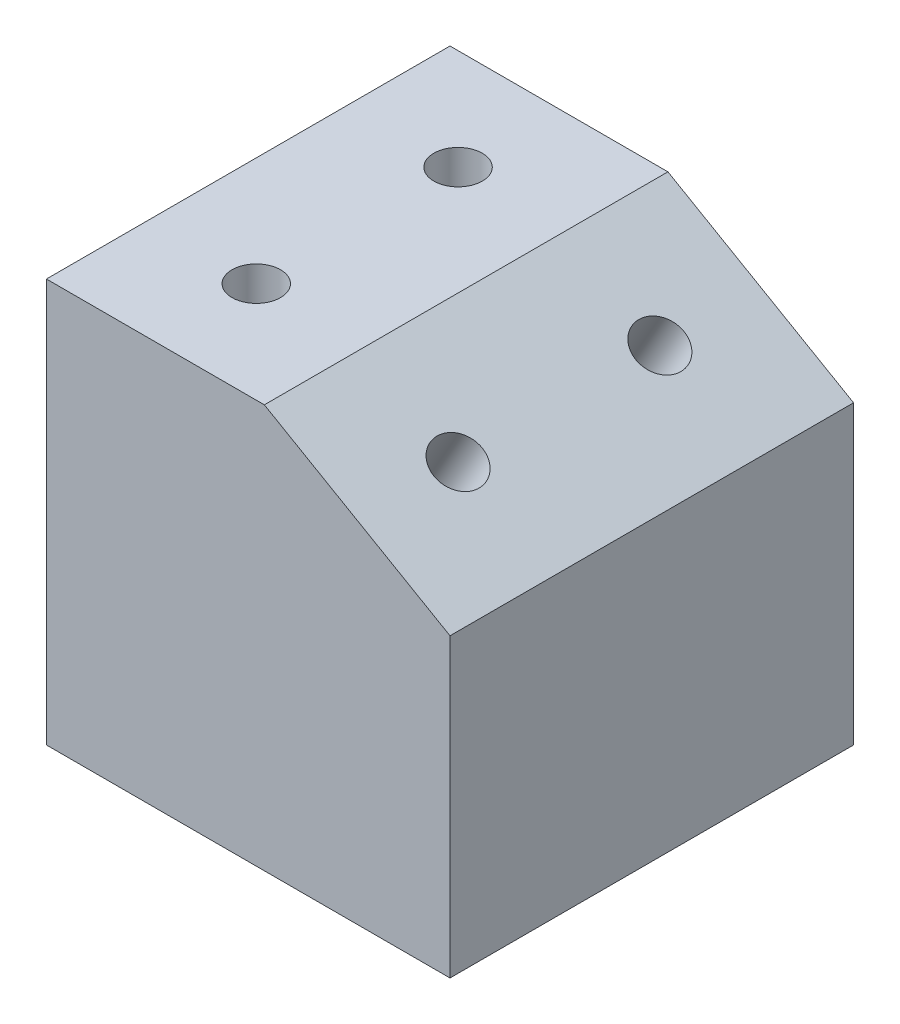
ISO-10303-21;
HEADER;
FILE_DESCRIPTION(('STEP AP214'),'2;1');
FILE_NAME('part.step','',(''),(''),'','','');
FILE_SCHEMA(('AUTOMOTIVE_DESIGN { 1 0 10303 214 1 1 1 1 }'));
ENDSEC;
DATA;
#1=APPLICATION_CONTEXT('core data for automotive mechanical design processes');
#2=APPLICATION_PROTOCOL_DEFINITION('international standard','automotive_design',2000,#1);
#3=PRODUCT_CONTEXT('',#1,'mechanical');
#4=PRODUCT('Part','Part','',(#3));
#5=PRODUCT_RELATED_PRODUCT_CATEGORY('part','',(#4));
#6=PRODUCT_DEFINITION_FORMATION('','',#4);
#7=PRODUCT_DEFINITION_CONTEXT('part definition',#1,'design');
#8=PRODUCT_DEFINITION('design','',#6,#7);
#9=PRODUCT_DEFINITION_SHAPE('','',#8);
#10=(LENGTH_UNIT() NAMED_UNIT(*) SI_UNIT(.MILLI.,.METRE.));
#11=(NAMED_UNIT(*) PLANE_ANGLE_UNIT() SI_UNIT($,.RADIAN.));
#12=(NAMED_UNIT(*) SI_UNIT($,.STERADIAN.) SOLID_ANGLE_UNIT());
#13=UNCERTAINTY_MEASURE_WITH_UNIT(LENGTH_MEASURE(1.E-05),#10,'distance_accuracy_value','');
#14=(GEOMETRIC_REPRESENTATION_CONTEXT(3) GLOBAL_UNCERTAINTY_ASSIGNED_CONTEXT((#13)) GLOBAL_UNIT_ASSIGNED_CONTEXT((#10,
#11,#12)) REPRESENTATION_CONTEXT('',''));
#15=CARTESIAN_POINT('',(0.,0.,0.));
#16=DIRECTION('',(0.,0.,1.));
#17=DIRECTION('',(1.,0.,0.));
#18=AXIS2_PLACEMENT_3D('',#15,#16,#17);
#19=CARTESIAN_POINT('',(-25.,-25.,50.));
#20=DIRECTION('',(1.,0.,0.));
#21=DIRECTION('',(0.,0.,-1.));
#22=AXIS2_PLACEMENT_3D('',#19,#20,#21);
#23=PLANE('',#22);
#24=CARTESIAN_POINT('',(-25.,5.,5.00000000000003));
#25=DIRECTION('',(-1.,0.,0.));
#26=DIRECTION('',(0.,0.,1.));
#27=AXIS2_PLACEMENT_3D('',#24,#25,#26);
#28=CIRCLE('',#27,3.4);
#29=CARTESIAN_POINT('',(-25.,5.,8.40000000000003));
#30=VERTEX_POINT('',#29);
#31=EDGE_CURVE('E279',#30,#30,#28,.T.);
#32=ORIENTED_EDGE('',*,*,#31,.F.);
#33=EDGE_LOOP('',(#32));
#34=FACE_BOUND('',#33,.T.);
#35=CARTESIAN_POINT('',(-25.,5.,45.));
#36=DIRECTION('',(-1.,0.,0.));
#37=DIRECTION('',(0.,0.,1.));
#38=AXIS2_PLACEMENT_3D('',#35,#36,#37);
#39=CIRCLE('',#38,3.4);
#40=CARTESIAN_POINT('',(-25.,5.,48.4));
#41=VERTEX_POINT('',#40);
#42=EDGE_CURVE('E278',#41,#41,#39,.T.);
#43=ORIENTED_EDGE('',*,*,#42,.F.);
#44=EDGE_LOOP('',(#43));
#45=FACE_BOUND('',#44,.T.);
#46=CARTESIAN_POINT('',(-25.,-15.,5.00000000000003));
#47=DIRECTION('',(-1.,0.,0.));
#48=DIRECTION('',(0.,0.,1.));
#49=AXIS2_PLACEMENT_3D('',#46,#47,#48);
#50=CIRCLE('',#49,3.4);
#51=CARTESIAN_POINT('',(-25.,-15.,8.40000000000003));
#52=VERTEX_POINT('',#51);
#53=EDGE_CURVE('E250',#52,#52,#50,.T.);
#54=ORIENTED_EDGE('',*,*,#53,.F.);
#55=EDGE_LOOP('',(#54));
#56=FACE_BOUND('',#55,.T.);
#57=CARTESIAN_POINT('',(-25.,-15.,45.));
#58=DIRECTION('',(-1.,0.,0.));
#59=DIRECTION('',(0.,0.,1.));
#60=AXIS2_PLACEMENT_3D('',#57,#58,#59);
#61=CIRCLE('',#60,3.4);
#62=CARTESIAN_POINT('',(-25.,-15.,48.4));
#63=VERTEX_POINT('',#62);
#64=EDGE_CURVE('E249',#63,#63,#61,.T.);
#65=ORIENTED_EDGE('',*,*,#64,.F.);
#66=EDGE_LOOP('',(#65));
#67=FACE_BOUND('',#66,.T.);
#68=CARTESIAN_POINT('',(-25.,-5.,37.5));
#69=DIRECTION('',(-1.,0.,0.));
#70=DIRECTION('',(0.,0.,1.));
#71=AXIS2_PLACEMENT_3D('',#68,#69,#70);
#72=CIRCLE('',#71,5.99999999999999);
#73=CARTESIAN_POINT('',(-25.,-5.,43.5));
#74=VERTEX_POINT('',#73);
#75=EDGE_CURVE('E328',#74,#74,#72,.T.);
#76=ORIENTED_EDGE('',*,*,#75,.F.);
#77=EDGE_LOOP('',(#76));
#78=FACE_BOUND('',#77,.T.);
#79=CARTESIAN_POINT('',(-25.,-5.,12.5));
#80=DIRECTION('',(-1.,0.,0.));
#81=DIRECTION('',(0.,0.,1.));
#82=AXIS2_PLACEMENT_3D('',#79,#80,#81);
#83=CIRCLE('',#82,5.99999999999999);
#84=CARTESIAN_POINT('',(-25.,-5.,18.5));
#85=VERTEX_POINT('',#84);
#86=EDGE_CURVE('E408',#85,#85,#83,.T.);
#87=ORIENTED_EDGE('',*,*,#86,.F.);
#88=EDGE_LOOP('',(#87));
#89=FACE_BOUND('',#88,.T.);
#90=DIRECTION('',(0.,-1.,0.));
#91=VECTOR('',#90,1.);
#92=CARTESIAN_POINT('',(-25.,-25.,0.));
#93=LINE('',#92,#91);
#94=CARTESIAN_POINT('',(-25.,25.,0.));
#95=VERTEX_POINT('',#94);
#96=CARTESIAN_POINT('',(-25.,-25.,0.));
#97=VERTEX_POINT('',#96);
#98=EDGE_CURVE('E127',#95,#97,#93,.T.);
#99=ORIENTED_EDGE('',*,*,#98,.T.);
#100=DIRECTION('',(0.,0.,-1.));
#101=VECTOR('',#100,1.);
#102=CARTESIAN_POINT('',(-25.,-25.,50.));
#103=LINE('',#102,#101);
#104=CARTESIAN_POINT('',(-25.,-25.,50.));
#105=VERTEX_POINT('',#104);
#106=EDGE_CURVE('E11',#105,#97,#103,.T.);
#107=ORIENTED_EDGE('',*,*,#106,.F.);
#108=DIRECTION('',(0.,-1.,0.));
#109=VECTOR('',#108,1.);
#110=CARTESIAN_POINT('',(-25.,-25.,50.));
#111=LINE('',#110,#109);
#112=CARTESIAN_POINT('',(-25.,25.,50.));
#113=VERTEX_POINT('',#112);
#114=EDGE_CURVE('E137',#113,#105,#111,.T.);
#115=ORIENTED_EDGE('',*,*,#114,.F.);
#116=DIRECTION('',(0.,0.,-1.));
#117=VECTOR('',#116,1.);
#118=CARTESIAN_POINT('',(-25.,25.,50.));
#119=LINE('',#118,#117);
#120=EDGE_CURVE('E123',#113,#95,#119,.T.);
#121=ORIENTED_EDGE('',*,*,#120,.T.);
#122=EDGE_LOOP('',(#99,#107,#115,#121));
#123=FACE_BOUND('',#122,.T.);
#124=ADVANCED_FACE('F40',(#34,#45,#56,#67,#78,#89,#123),#23,.F.);
#125=CARTESIAN_POINT('',(-25.,-25.,50.));
#126=DIRECTION('',(0.,1.,0.));
#127=DIRECTION('',(0.,0.,1.));
#128=AXIS2_PLACEMENT_3D('',#125,#126,#127);
#129=PLANE('',#128);
#130=DIRECTION('',(1.,0.,0.));
#131=VECTOR('',#130,1.);
#132=CARTESIAN_POINT('',(-25.,-25.,0.));
#133=LINE('',#132,#131);
#134=CARTESIAN_POINT('',(25.,-25.,0.));
#135=VERTEX_POINT('',#134);
#136=EDGE_CURVE('E130',#97,#135,#133,.T.);
#137=ORIENTED_EDGE('',*,*,#136,.T.);
#138=DIRECTION('',(0.,0.,-1.));
#139=VECTOR('',#138,1.);
#140=CARTESIAN_POINT('',(25.,-25.,50.));
#141=LINE('',#140,#139);
#142=CARTESIAN_POINT('',(25.,-25.,50.));
#143=VERTEX_POINT('',#142);
#144=EDGE_CURVE('E53',#143,#135,#141,.T.);
#145=ORIENTED_EDGE('',*,*,#144,.F.);
#146=DIRECTION('',(1.,0.,0.));
#147=VECTOR('',#146,1.);
#148=CARTESIAN_POINT('',(-25.,-25.,50.));
#149=LINE('',#148,#147);
#150=EDGE_CURVE('E97',#105,#143,#149,.T.);
#151=ORIENTED_EDGE('',*,*,#150,.F.);
#152=ORIENTED_EDGE('',*,*,#106,.T.);
#153=EDGE_LOOP('',(#137,#145,#151,#152));
#154=FACE_BOUND('',#153,.T.);
#155=ADVANCED_FACE('F193',(#154),#129,.F.);
#156=CARTESIAN_POINT('',(25.,-25.,50.));
#157=DIRECTION('',(-1.,0.,0.));
#158=DIRECTION('',(0.,-1.,0.));
#159=AXIS2_PLACEMENT_3D('',#156,#157,#158);
#160=PLANE('',#159);
#161=DIRECTION('',(0.,1.,0.));
#162=VECTOR('',#161,1.);
#163=CARTESIAN_POINT('',(25.,-25.,0.));
#164=LINE('',#163,#162);
#165=CARTESIAN_POINT('',(25.,11.7209438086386,0.));
#166=VERTEX_POINT('',#165);
#167=EDGE_CURVE('E114',#135,#166,#164,.T.);
#168=ORIENTED_EDGE('',*,*,#167,.T.);
#169=DIRECTION('',(0.,0.,-1.));
#170=VECTOR('',#169,1.);
#171=CARTESIAN_POINT('',(25.,11.7209438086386,50.));
#172=LINE('',#171,#170);
#173=CARTESIAN_POINT('',(25.,11.7209438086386,50.));
#174=VERTEX_POINT('',#173);
#175=EDGE_CURVE('E111',#174,#166,#172,.T.);
#176=ORIENTED_EDGE('',*,*,#175,.F.);
#177=DIRECTION('',(0.,1.,0.));
#178=VECTOR('',#177,1.);
#179=CARTESIAN_POINT('',(25.,-25.,50.));
#180=LINE('',#179,#178);
#181=EDGE_CURVE('E103',#143,#174,#180,.T.);
#182=ORIENTED_EDGE('',*,*,#181,.F.);
#183=ORIENTED_EDGE('',*,*,#144,.T.);
#184=EDGE_LOOP('',(#168,#176,#182,#183));
#185=FACE_BOUND('',#184,.T.);
#186=ADVANCED_FACE('F112',(#185),#160,.F.);
#187=CARTESIAN_POINT('',(1.99999999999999,25.,50.));
#188=DIRECTION('',(-0.500000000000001,-0.866025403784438,0.));
#189=DIRECTION('',(0.866025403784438,-0.500000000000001,0.));
#190=AXIS2_PLACEMENT_3D('',#187,#188,#189);
#191=PLANE('',#190);
#192=CARTESIAN_POINT('',(13.5,18.3604719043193,12.5));
#193=DIRECTION('',(0.500000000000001,0.866025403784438,0.));
#194=DIRECTION('',(-0.866025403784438,0.500000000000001,0.));
#195=AXIS2_PLACEMENT_3D('',#192,#193,#194);
#196=CIRCLE('',#195,3.);
#197=CARTESIAN_POINT('',(10.9019237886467,19.8604719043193,12.5));
#198=VERTEX_POINT('',#197);
#199=EDGE_CURVE('E168',#198,#198,#196,.T.);
#200=ORIENTED_EDGE('',*,*,#199,.F.);
#201=EDGE_LOOP('',(#200));
#202=FACE_BOUND('',#201,.T.);
#203=CARTESIAN_POINT('',(13.5,18.3604719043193,37.5));
#204=DIRECTION('',(0.500000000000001,0.866025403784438,0.));
#205=DIRECTION('',(-0.866025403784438,0.500000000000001,0.));
#206=AXIS2_PLACEMENT_3D('',#203,#204,#205);
#207=CIRCLE('',#206,3.);
#208=CARTESIAN_POINT('',(10.9019237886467,19.8604719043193,37.5));
#209=VERTEX_POINT('',#208);
#210=EDGE_CURVE('E211',#209,#209,#207,.T.);
#211=ORIENTED_EDGE('',*,*,#210,.F.);
#212=EDGE_LOOP('',(#211));
#213=FACE_BOUND('',#212,.T.);
#214=DIRECTION('',(-0.866025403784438,0.500000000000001,0.));
#215=VECTOR('',#214,1.);
#216=CARTESIAN_POINT('',(1.99999999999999,25.,0.));
#217=LINE('',#216,#215);
#218=CARTESIAN_POINT('',(1.99999999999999,25.,0.));
#219=VERTEX_POINT('',#218);
#220=EDGE_CURVE('E83',#166,#219,#217,.T.);
#221=ORIENTED_EDGE('',*,*,#220,.T.);
#222=DIRECTION('',(0.,0.,-1.));
#223=VECTOR('',#222,1.);
#224=CARTESIAN_POINT('',(1.99999999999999,25.,50.));
#225=LINE('',#224,#223);
#226=CARTESIAN_POINT('',(1.99999999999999,25.,50.));
#227=VERTEX_POINT('',#226);
#228=EDGE_CURVE('E116',#227,#219,#225,.T.);
#229=ORIENTED_EDGE('',*,*,#228,.F.);
#230=DIRECTION('',(-0.866025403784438,0.500000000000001,0.));
#231=VECTOR('',#230,1.);
#232=CARTESIAN_POINT('',(1.99999999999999,25.,50.));
#233=LINE('',#232,#231);
#234=EDGE_CURVE('E107',#174,#227,#233,.T.);
#235=ORIENTED_EDGE('',*,*,#234,.F.);
#236=ORIENTED_EDGE('',*,*,#175,.T.);
#237=EDGE_LOOP('',(#221,#229,#235,#236));
#238=FACE_BOUND('',#237,.T.);
#239=ADVANCED_FACE('F118',(#202,#213,#238),#191,.F.);
#240=CARTESIAN_POINT('',(-25.,25.,50.));
#241=DIRECTION('',(0.,-1.,0.));
#242=DIRECTION('',(0.,0.,-1.));
#243=AXIS2_PLACEMENT_3D('',#240,#241,#242);
#244=PLANE('',#243);
#245=CARTESIAN_POINT('',(-11.5,25.,37.5));
#246=DIRECTION('',(0.,1.,0.));
#247=DIRECTION('',(0.,0.,1.));
#248=AXIS2_PLACEMENT_3D('',#245,#246,#247);
#249=CIRCLE('',#248,3.);
#250=CARTESIAN_POINT('',(-11.5,25.,40.5));
#251=VERTEX_POINT('',#250);
#252=EDGE_CURVE('E208',#251,#251,#249,.T.);
#253=ORIENTED_EDGE('',*,*,#252,.F.);
#254=EDGE_LOOP('',(#253));
#255=FACE_BOUND('',#254,.T.);
#256=CARTESIAN_POINT('',(-11.5,25.,12.5));
#257=DIRECTION('',(0.,1.,0.));
#258=DIRECTION('',(0.,0.,1.));
#259=AXIS2_PLACEMENT_3D('',#256,#257,#258);
#260=CIRCLE('',#259,3.);
#261=CARTESIAN_POINT('',(-11.5,25.,15.5));
#262=VERTEX_POINT('',#261);
#263=EDGE_CURVE('E131',#262,#262,#260,.T.);
#264=ORIENTED_EDGE('',*,*,#263,.F.);
#265=EDGE_LOOP('',(#264));
#266=FACE_BOUND('',#265,.T.);
#267=DIRECTION('',(-1.,0.,0.));
#268=VECTOR('',#267,1.);
#269=CARTESIAN_POINT('',(-25.,25.,0.));
#270=LINE('',#269,#268);
#271=EDGE_CURVE('E89',#219,#95,#270,.T.);
#272=ORIENTED_EDGE('',*,*,#271,.T.);
#273=ORIENTED_EDGE('',*,*,#120,.F.);
#274=DIRECTION('',(-1.,0.,0.));
#275=VECTOR('',#274,1.);
#276=CARTESIAN_POINT('',(-25.,25.,50.));
#277=LINE('',#276,#275);
#278=EDGE_CURVE('E62',#227,#113,#277,.T.);
#279=ORIENTED_EDGE('',*,*,#278,.F.);
#280=ORIENTED_EDGE('',*,*,#228,.T.);
#281=EDGE_LOOP('',(#272,#273,#279,#280));
#282=FACE_BOUND('',#281,.T.);
#283=ADVANCED_FACE('F182',(#255,#266,#282),#244,.F.);
#284=CARTESIAN_POINT('',(-25.,25.,50.));
#285=DIRECTION('',(0.,0.,-1.));
#286=DIRECTION('',(-1.,0.,0.));
#287=AXIS2_PLACEMENT_3D('',#284,#285,#286);
#288=PLANE('',#287);
#289=ORIENTED_EDGE('',*,*,#114,.T.);
#290=ORIENTED_EDGE('',*,*,#150,.T.);
#291=ORIENTED_EDGE('',*,*,#181,.T.);
#292=ORIENTED_EDGE('',*,*,#234,.T.);
#293=ORIENTED_EDGE('',*,*,#278,.T.);
#294=EDGE_LOOP('',(#289,#290,#291,#292,#293));
#295=FACE_BOUND('',#294,.T.);
#296=ADVANCED_FACE('F105',(#295),#288,.F.);
#297=CARTESIAN_POINT('',(-25.,25.,0.));
#298=DIRECTION('',(0.,0.,-1.));
#299=DIRECTION('',(-1.,0.,0.));
#300=AXIS2_PLACEMENT_3D('',#297,#298,#299);
#301=PLANE('',#300);
#302=ORIENTED_EDGE('',*,*,#98,.F.);
#303=ORIENTED_EDGE('',*,*,#271,.F.);
#304=ORIENTED_EDGE('',*,*,#220,.F.);
#305=ORIENTED_EDGE('',*,*,#167,.F.);
#306=ORIENTED_EDGE('',*,*,#136,.F.);
#307=EDGE_LOOP('',(#302,#303,#304,#305,#306));
#308=FACE_BOUND('',#307,.T.);
#309=ADVANCED_FACE('F177',(#308),#301,.T.);
#310=CARTESIAN_POINT('',(-11.5,25.,12.5));
#311=DIRECTION('',(0.,1.,0.));
#312=DIRECTION('',(0.,0.,1.));
#313=AXIS2_PLACEMENT_3D('',#310,#311,#312);
#314=CYLINDRICAL_SURFACE('',#313,2.99999999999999);
#315=CARTESIAN_POINT('',(-11.5,-2.35424868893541,15.5));
#316=CARTESIAN_POINT('',(-11.5700400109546,-2.354254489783,15.5000028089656));
#317=CARTESIAN_POINT('',(-11.6400576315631,-2.35145244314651,15.4975409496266));
#318=CARTESIAN_POINT('',(-11.7793383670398,-2.34045062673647,15.4877833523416));
#319=CARTESIAN_POINT('',(-11.8486012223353,-2.3322490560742,15.480486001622));
#320=CARTESIAN_POINT('',(-12.0545126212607,-2.30015554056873,15.45155901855));
#321=CARTESIAN_POINT('',(-12.1890739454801,-2.26877696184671,15.4228952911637));
#322=CARTESIAN_POINT('',(-12.4471981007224,-2.19250585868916,15.3496790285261));
#323=CARTESIAN_POINT('',(-12.5708870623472,-2.14780575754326,15.3053511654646));
#324=CARTESIAN_POINT('',(-12.8086814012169,-2.05026817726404,15.2026116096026));
#325=CARTESIAN_POINT('',(-12.9227879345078,-1.9974316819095,15.1442016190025));
#326=CARTESIAN_POINT('',(-13.1642251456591,-1.87645673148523,15.0008027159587));
#327=CARTESIAN_POINT('',(-13.2893199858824,-1.80743115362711,14.9128092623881));
#328=CARTESIAN_POINT('',(-13.5250668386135,-1.66956747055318,14.7186541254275));
#329=CARTESIAN_POINT('',(-13.6356971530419,-1.6007297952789,14.612465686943));
#330=CARTESIAN_POINT('',(-13.8000031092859,-1.49460230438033,14.4283649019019));
#331=CARTESIAN_POINT('',(-13.8588495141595,-1.45564034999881,14.3559702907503));
#332=CARTESIAN_POINT('',(-13.9701454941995,-1.38061811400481,14.2050418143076));
#333=CARTESIAN_POINT('',(-14.0225980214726,-1.34455649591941,14.1265108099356));
#334=CARTESIAN_POINT('',(-14.1204139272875,-1.27638042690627,13.9637040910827));
#335=CARTESIAN_POINT('',(-14.1657882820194,-1.24425988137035,13.8794375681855));
#336=CARTESIAN_POINT('',(-14.2487852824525,-1.18490087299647,13.7055949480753));
#337=CARTESIAN_POINT('',(-14.2864120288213,-1.15765982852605,13.6160216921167));
#338=CARTESIAN_POINT('',(-14.366379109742,-1.09934592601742,13.3957994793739));
#339=CARTESIAN_POINT('',(-14.4047044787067,-1.07101411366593,13.2629085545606));
#340=CARTESIAN_POINT('',(-14.4627899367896,-1.02787895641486,12.9910887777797));
#341=CARTESIAN_POINT('',(-14.4825661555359,-1.01306385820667,12.852165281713));
#342=CARTESIAN_POINT('',(-14.5024408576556,-0.998174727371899,12.5717346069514));
#343=CARTESIAN_POINT('',(-14.502488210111,-0.998138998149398,12.4302216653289));
#344=CARTESIAN_POINT('',(-14.4827648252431,-1.01291527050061,12.1493665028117));
#345=CARTESIAN_POINT('',(-14.4629894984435,-1.02773071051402,12.0100247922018));
#346=CARTESIAN_POINT('',(-14.4058377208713,-1.07017259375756,11.7422219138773));
#347=CARTESIAN_POINT('',(-14.3690872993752,-1.0973428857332,11.6135515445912));
#348=CARTESIAN_POINT('',(-14.2800087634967,-1.16235438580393,11.3646389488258));
#349=CARTESIAN_POINT('',(-14.2276772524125,-1.20019792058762,11.2443985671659));
#350=CARTESIAN_POINT('',(-14.1029407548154,-1.28877909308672,11.0015661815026));
#351=CARTESIAN_POINT('',(-14.0289758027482,-1.34046919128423,10.8801292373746));
#352=CARTESIAN_POINT('',(-13.8665325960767,-1.45078594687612,10.6508654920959));
#353=CARTESIAN_POINT('',(-13.7780419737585,-1.50941850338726,10.543050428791));
#354=CARTESIAN_POINT('',(-13.569553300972,-1.64212468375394,10.3218359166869));
#355=CARTESIAN_POINT('',(-13.4467815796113,-1.71696688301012,10.2115101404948));
#356=CARTESIAN_POINT('',(-13.1843308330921,-1.86548083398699,10.0119824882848));
#357=CARTESIAN_POINT('',(-13.0446438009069,-1.93915201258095,9.92279067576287));
#358=CARTESIAN_POINT('',(-12.7780362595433,-2.06361148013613,9.78253587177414));
#359=CARTESIAN_POINT('',(-12.6540259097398,-2.11604800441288,9.72742266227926));
#360=CARTESIAN_POINT('',(-12.3958694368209,-2.20926517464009,9.63361205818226));
#361=CARTESIAN_POINT('',(-12.2617470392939,-2.25007209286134,9.59487756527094));
#362=CARTESIAN_POINT('',(-12.012626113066,-2.30719898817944,9.54195229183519));
#363=CARTESIAN_POINT('',(-11.899105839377,-2.32676921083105,9.52441860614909));
#364=CARTESIAN_POINT('',(-11.6692890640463,-2.35128822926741,9.50256479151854));
#365=CARTESIAN_POINT('',(-11.5529963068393,-2.35625573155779,9.49822775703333));
#366=CARTESIAN_POINT('',(-11.3210420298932,-2.35074263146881,9.50309458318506));
#367=CARTESIAN_POINT('',(-11.2053807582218,-2.3402563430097,9.51230342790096));
#368=CARTESIAN_POINT('',(-10.9778476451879,-2.3055755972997,9.54354950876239));
#369=CARTESIAN_POINT('',(-10.8659826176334,-2.28135774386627,9.56560864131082));
#370=CARTESIAN_POINT('',(-10.6073241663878,-2.21144497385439,9.63172053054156));
#371=CARTESIAN_POINT('',(-10.4631292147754,-2.16110413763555,9.680914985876));
#372=CARTESIAN_POINT('',(-10.1873835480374,-2.04924216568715,9.79822366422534));
#373=CARTESIAN_POINT('',(-10.0558567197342,-1.98770051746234,9.86637272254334));
#374=CARTESIAN_POINT('',(-9.80130638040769,-1.85783674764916,10.0225997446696));
#375=CARTESIAN_POINT('',(-9.6787509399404,-1.78935141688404,10.1112996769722));
#376=CARTESIAN_POINT('',(-9.44797910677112,-1.65304077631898,10.3063668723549));
#377=CARTESIAN_POINT('',(-9.33976972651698,-1.58521580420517,10.4127427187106));
#378=CARTESIAN_POINT('',(-9.17846786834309,-1.48042922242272,10.5976018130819));
#379=CARTESIAN_POINT('',(-9.1203418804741,-1.44174966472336,10.6707769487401));
#380=CARTESIAN_POINT('',(-9.01056185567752,-1.36741600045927,10.8232422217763));
#381=CARTESIAN_POINT('',(-8.95890478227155,-1.33176047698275,10.9025294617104));
#382=CARTESIAN_POINT('',(-8.8627586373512,-1.26451277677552,11.0668220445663));
#383=CARTESIAN_POINT('',(-8.8182599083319,-1.23291513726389,11.1518194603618));
#384=CARTESIAN_POINT('',(-8.73711665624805,-1.17472525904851,11.3270546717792));
#385=CARTESIAN_POINT('',(-8.70046789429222,-1.14813031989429,11.4172896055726));
#386=CARTESIAN_POINT('',(-8.6231605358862,-1.09164326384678,11.6384264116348));
#387=CARTESIAN_POINT('',(-8.5864961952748,-1.06449884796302,11.7714832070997));
#388=CARTESIAN_POINT('',(-8.53173263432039,-1.02378628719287,12.0432877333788));
#389=CARTESIAN_POINT('',(-8.51361681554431,-1.0102060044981,12.1820302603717));
#390=CARTESIAN_POINT('',(-8.49696984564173,-0.997730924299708,12.4617003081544));
#391=CARTESIAN_POINT('',(-8.49848466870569,-0.99887060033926,12.6026321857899));
#392=CARTESIAN_POINT('',(-8.52112127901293,-1.01582333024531,12.8820192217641));
#393=CARTESIAN_POINT('',(-8.54224828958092,-1.03164029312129,13.0204737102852));
#394=CARTESIAN_POINT('',(-8.60195001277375,-1.07593213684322,13.287043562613));
#395=CARTESIAN_POINT('',(-8.64000041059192,-1.10402622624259,13.4153423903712));
#396=CARTESIAN_POINT('',(-8.73157608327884,-1.17074554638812,13.6633227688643));
#397=CARTESIAN_POINT('',(-8.78510466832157,-1.20937302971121,13.7830024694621));
#398=CARTESIAN_POINT('',(-8.91255588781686,-1.29964717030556,14.0250953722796));
#399=CARTESIAN_POINT('',(-8.98810185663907,-1.35227295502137,14.1462824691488));
#400=CARTESIAN_POINT('',(-9.15373288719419,-1.46428986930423,14.3748296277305));
#401=CARTESIAN_POINT('',(-9.24383131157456,-1.52368720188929,14.482176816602));
#402=CARTESIAN_POINT('',(-9.45601068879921,-1.65787296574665,14.7022476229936));
#403=CARTESIAN_POINT('',(-9.58089261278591,-1.73338165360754,14.811833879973));
#404=CARTESIAN_POINT('',(-9.84773632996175,-1.88267824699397,15.009505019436));
#405=CARTESIAN_POINT('',(-9.98970435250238,-1.95646551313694,15.0975820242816));
#406=CARTESIAN_POINT('',(-10.2577659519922,-2.07900827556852,15.2339195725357));
#407=CARTESIAN_POINT('',(-10.3806681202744,-2.12972852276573,15.2866710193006));
#408=CARTESIAN_POINT('',(-10.6361676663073,-2.21934768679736,15.376107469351));
#409=CARTESIAN_POINT('',(-10.768738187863,-2.2582779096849,15.4128351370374));
#410=CARTESIAN_POINT('',(-11.0015716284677,-2.30935419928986,15.4599424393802));
#411=CARTESIAN_POINT('',(-11.0999186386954,-2.32600598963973,15.4748891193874));
#412=CARTESIAN_POINT('',(-11.2988601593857,-2.34844550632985,15.4949126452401));
#413=CARTESIAN_POINT('',(-11.3994531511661,-2.35424036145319,15.499995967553));
#414=CARTESIAN_POINT('',(-11.5,-2.35424868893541,15.5));
#415=B_SPLINE_CURVE_WITH_KNOTS('',3,(#315,#316,#317,#318,#319,#320,#321,#322,#323,#324,#325,
#326,#327,#328,#329,#330,#331,#332,#333,#334,#335,#336,#337,#338,#339,#340,#341,#342,#343,#344,
#345,#346,#347,#348,#349,#350,#351,#352,#353,#354,#355,#356,#357,#358,#359,#360,#361,#362,#363,
#364,#365,#366,#367,#368,#369,#370,#371,#372,#373,#374,#375,#376,#377,#378,#379,#380,#381,#382,
#383,#384,#385,#386,#387,#388,#389,#390,#391,#392,#393,#394,#395,#396,#397,#398,#399,#400,#401,
#402,#403,#404,#405,#406,#407,#408,#409,#410,#411,#412,#413,#414),.UNSPECIFIED.,.T.,.F.,(4,2,2,
2,2,2,2,2,2,2,2,2,2,2,2,2,2,2,2,2,2,2,2,2,2,2,2,2,2,2,2,2,2,2,2,2,2,2,2,2,2,2,2,2,2,2,2,2,2,4),
(0.,0.209978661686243,0.420027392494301,0.840743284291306,1.25565461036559,1.67051580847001,
2.17226801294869,2.6747644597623,2.97770625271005,3.2805076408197,3.58283470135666,
3.88500133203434,4.30659768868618,4.7278271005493,5.15014819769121,5.57256709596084,
5.98051830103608,6.38855850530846,6.84078006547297,7.29338868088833,7.83503352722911,
8.37693577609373,8.812031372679,9.24613611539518,9.59420329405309,9.94182439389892,
10.2895734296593,10.6379167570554,11.116643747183,11.5962564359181,12.0929073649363,
12.5898001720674,12.8928465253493,13.1957500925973,13.4982415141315,13.8005691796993,
14.2206053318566,14.6402652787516,15.0609082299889,15.4816632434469,15.8902036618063,
16.2988315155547,16.7537484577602,17.2090855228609,17.7544990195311,18.3001119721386,
18.7279130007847,19.154567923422,19.4562036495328,19.7576412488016),.UNSPECIFIED.);
#416=CARTESIAN_POINT('',(-11.5,-2.35424868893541,15.5));
#417=VERTEX_POINT('',#416);
#418=EDGE_CURVE('E147',#417,#417,#415,.T.);
#419=ORIENTED_EDGE('',*,*,#418,.T.);
#420=EDGE_LOOP('',(#419));
#421=FACE_BOUND('',#420,.T.);
#422=ORIENTED_EDGE('',*,*,#263,.T.);
#423=EDGE_LOOP('',(#422));
#424=FACE_BOUND('',#423,.T.);
#425=ADVANCED_FACE('F171',(#421,#424),#314,.F.);
#426=CARTESIAN_POINT('',(-11.5,25.,37.5));
#427=DIRECTION('',(0.,1.,0.));
#428=DIRECTION('',(0.,0.,1.));
#429=AXIS2_PLACEMENT_3D('',#426,#427,#428);
#430=CYLINDRICAL_SURFACE('',#429,2.99999999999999);
#431=CARTESIAN_POINT('',(-11.5,-2.35424868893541,40.5));
#432=CARTESIAN_POINT('',(-11.5700400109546,-2.354254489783,40.5000028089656));
#433=CARTESIAN_POINT('',(-11.6400576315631,-2.3514524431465,40.4975409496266));
#434=CARTESIAN_POINT('',(-11.7793383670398,-2.34045062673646,40.4877833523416));
#435=CARTESIAN_POINT('',(-11.8486012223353,-2.3322490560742,40.4804860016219));
#436=CARTESIAN_POINT('',(-12.0545126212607,-2.30015554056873,40.45155901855));
#437=CARTESIAN_POINT('',(-12.1890739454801,-2.2687769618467,40.4228952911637));
#438=CARTESIAN_POINT('',(-12.4471981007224,-2.19250585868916,40.349679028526));
#439=CARTESIAN_POINT('',(-12.5708870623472,-2.14780575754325,40.3053511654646));
#440=CARTESIAN_POINT('',(-12.8086814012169,-2.05026817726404,40.2026116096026));
#441=CARTESIAN_POINT('',(-12.9227879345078,-1.9974316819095,40.1442016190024));
#442=CARTESIAN_POINT('',(-13.1642251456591,-1.87645673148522,40.0008027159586));
#443=CARTESIAN_POINT('',(-13.2893199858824,-1.80743115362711,39.9128092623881));
#444=CARTESIAN_POINT('',(-13.5250668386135,-1.66956747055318,39.7186541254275));
#445=CARTESIAN_POINT('',(-13.6356971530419,-1.6007297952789,39.612465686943));
#446=CARTESIAN_POINT('',(-13.8000031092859,-1.49460230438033,39.4283649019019));
#447=CARTESIAN_POINT('',(-13.8588495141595,-1.45564034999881,39.3559702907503));
#448=CARTESIAN_POINT('',(-13.9701454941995,-1.38061811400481,39.2050418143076));
#449=CARTESIAN_POINT('',(-14.0225980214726,-1.3445564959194,39.1265108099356));
#450=CARTESIAN_POINT('',(-14.1204139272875,-1.27638042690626,38.9637040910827));
#451=CARTESIAN_POINT('',(-14.1657882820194,-1.24425988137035,38.8794375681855));
#452=CARTESIAN_POINT('',(-14.2487852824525,-1.18490087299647,38.7055949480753));
#453=CARTESIAN_POINT('',(-14.2864120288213,-1.15765982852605,38.6160216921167));
#454=CARTESIAN_POINT('',(-14.366379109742,-1.09934592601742,38.3957994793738));
#455=CARTESIAN_POINT('',(-14.4047044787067,-1.07101411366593,38.2629085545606));
#456=CARTESIAN_POINT('',(-14.4627899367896,-1.02787895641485,37.9910887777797));
#457=CARTESIAN_POINT('',(-14.4825661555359,-1.01306385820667,37.852165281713));
#458=CARTESIAN_POINT('',(-14.5024408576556,-0.998174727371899,37.5717346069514));
#459=CARTESIAN_POINT('',(-14.502488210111,-0.998138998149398,37.4302216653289));
#460=CARTESIAN_POINT('',(-14.4827648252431,-1.01291527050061,37.1493665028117));
#461=CARTESIAN_POINT('',(-14.4629894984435,-1.02773071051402,37.0100247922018));
#462=CARTESIAN_POINT('',(-14.4058377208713,-1.07017259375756,36.7422219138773));
#463=CARTESIAN_POINT('',(-14.3690872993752,-1.0973428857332,36.6135515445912));
#464=CARTESIAN_POINT('',(-14.2800087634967,-1.16235438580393,36.3646389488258));
#465=CARTESIAN_POINT('',(-14.2276772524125,-1.20019792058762,36.2443985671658));
#466=CARTESIAN_POINT('',(-14.1029407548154,-1.28877909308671,36.0015661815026));
#467=CARTESIAN_POINT('',(-14.0289758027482,-1.34046919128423,35.8801292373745));
#468=CARTESIAN_POINT('',(-13.8665325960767,-1.45078594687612,35.6508654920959));
#469=CARTESIAN_POINT('',(-13.7780419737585,-1.50941850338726,35.543050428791));
#470=CARTESIAN_POINT('',(-13.569553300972,-1.64212468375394,35.3218359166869));
#471=CARTESIAN_POINT('',(-13.4467815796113,-1.71696688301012,35.2115101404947));
#472=CARTESIAN_POINT('',(-13.1843308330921,-1.86548083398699,35.0119824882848));
#473=CARTESIAN_POINT('',(-13.0446438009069,-1.93915201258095,34.9227906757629));
#474=CARTESIAN_POINT('',(-12.7780362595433,-2.06361148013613,34.7825358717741));
#475=CARTESIAN_POINT('',(-12.6540259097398,-2.11604800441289,34.7274226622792));
#476=CARTESIAN_POINT('',(-12.3958694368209,-2.20926517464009,34.6336120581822));
#477=CARTESIAN_POINT('',(-12.2617470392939,-2.25007209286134,34.5948775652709));
#478=CARTESIAN_POINT('',(-12.012626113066,-2.30719898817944,34.5419522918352));
#479=CARTESIAN_POINT('',(-11.899105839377,-2.32676921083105,34.5244186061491));
#480=CARTESIAN_POINT('',(-11.6692890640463,-2.35128822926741,34.5025647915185));
#481=CARTESIAN_POINT('',(-11.5529963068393,-2.3562557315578,34.4982277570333));
#482=CARTESIAN_POINT('',(-11.3210420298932,-2.35074263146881,34.503094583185));
#483=CARTESIAN_POINT('',(-11.2053807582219,-2.34025634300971,34.5123034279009));
#484=CARTESIAN_POINT('',(-10.9778476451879,-2.30557559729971,34.5435495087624));
#485=CARTESIAN_POINT('',(-10.8659826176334,-2.28135774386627,34.5656086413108));
#486=CARTESIAN_POINT('',(-10.6073241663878,-2.2114449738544,34.6317205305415));
#487=CARTESIAN_POINT('',(-10.4631292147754,-2.16110413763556,34.680914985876));
#488=CARTESIAN_POINT('',(-10.1873835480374,-2.04924216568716,34.7982236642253));
#489=CARTESIAN_POINT('',(-10.0558567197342,-1.98770051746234,34.8663727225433));
#490=CARTESIAN_POINT('',(-9.8013063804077,-1.85783674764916,35.0225997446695));
#491=CARTESIAN_POINT('',(-9.67875093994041,-1.78935141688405,35.1112996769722));
#492=CARTESIAN_POINT('',(-9.44797910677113,-1.65304077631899,35.3063668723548));
#493=CARTESIAN_POINT('',(-9.33976972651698,-1.58521580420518,35.4127427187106));
#494=CARTESIAN_POINT('',(-9.1784678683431,-1.48042922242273,35.5976018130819));
#495=CARTESIAN_POINT('',(-9.1203418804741,-1.44174966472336,35.67077694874));
#496=CARTESIAN_POINT('',(-9.01056185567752,-1.36741600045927,35.8232422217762));
#497=CARTESIAN_POINT('',(-8.95890478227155,-1.33176047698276,35.9025294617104));
#498=CARTESIAN_POINT('',(-8.8627586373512,-1.26451277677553,36.0668220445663));
#499=CARTESIAN_POINT('',(-8.8182599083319,-1.2329151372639,36.1518194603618));
#500=CARTESIAN_POINT('',(-8.73711665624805,-1.17472525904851,36.3270546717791));
#501=CARTESIAN_POINT('',(-8.70046789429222,-1.14813031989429,36.4172896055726));
#502=CARTESIAN_POINT('',(-8.6231605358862,-1.09164326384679,36.6384264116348));
#503=CARTESIAN_POINT('',(-8.58649619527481,-1.06449884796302,36.7714832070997));
#504=CARTESIAN_POINT('',(-8.53173263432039,-1.02378628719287,37.0432877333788));
#505=CARTESIAN_POINT('',(-8.5136168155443,-1.0102060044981,37.1820302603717));
#506=CARTESIAN_POINT('',(-8.49696984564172,-0.997730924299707,37.4617003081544));
#507=CARTESIAN_POINT('',(-8.49848466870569,-0.998870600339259,37.6026321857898));
#508=CARTESIAN_POINT('',(-8.52112127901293,-1.01582333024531,37.8820192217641));
#509=CARTESIAN_POINT('',(-8.54224828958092,-1.03164029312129,38.0204737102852));
#510=CARTESIAN_POINT('',(-8.60195001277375,-1.07593213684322,38.287043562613));
#511=CARTESIAN_POINT('',(-8.64000041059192,-1.10402622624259,38.4153423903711));
#512=CARTESIAN_POINT('',(-8.73157608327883,-1.17074554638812,38.6633227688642));
#513=CARTESIAN_POINT('',(-8.78510466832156,-1.20937302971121,38.783002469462));
#514=CARTESIAN_POINT('',(-8.91255588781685,-1.29964717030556,39.0250953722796));
#515=CARTESIAN_POINT('',(-8.98810185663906,-1.35227295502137,39.1462824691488));
#516=CARTESIAN_POINT('',(-9.15373288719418,-1.46428986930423,39.3748296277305));
#517=CARTESIAN_POINT('',(-9.24383131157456,-1.52368720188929,39.482176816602));
#518=CARTESIAN_POINT('',(-9.45601068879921,-1.65787296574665,39.7022476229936));
#519=CARTESIAN_POINT('',(-9.58089261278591,-1.73338165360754,39.811833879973));
#520=CARTESIAN_POINT('',(-9.84773632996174,-1.88267824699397,40.009505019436));
#521=CARTESIAN_POINT('',(-9.98970435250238,-1.95646551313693,40.0975820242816));
#522=CARTESIAN_POINT('',(-10.2577659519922,-2.07900827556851,40.2339195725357));
#523=CARTESIAN_POINT('',(-10.3806681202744,-2.12972852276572,40.2866710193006));
#524=CARTESIAN_POINT('',(-10.6361676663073,-2.21934768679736,40.3761074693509));
#525=CARTESIAN_POINT('',(-10.768738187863,-2.2582779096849,40.4128351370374));
#526=CARTESIAN_POINT('',(-11.0015716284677,-2.30935419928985,40.4599424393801));
#527=CARTESIAN_POINT('',(-11.0999186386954,-2.32600598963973,40.4748891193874));
#528=CARTESIAN_POINT('',(-11.2988601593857,-2.34844550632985,40.4949126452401));
#529=CARTESIAN_POINT('',(-11.3994531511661,-2.35424036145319,40.4999959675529));
#530=CARTESIAN_POINT('',(-11.5,-2.35424868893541,40.5));
#531=B_SPLINE_CURVE_WITH_KNOTS('',3,(#431,#432,#433,#434,#435,#436,#437,#438,#439,#440,#441,
#442,#443,#444,#445,#446,#447,#448,#449,#450,#451,#452,#453,#454,#455,#456,#457,#458,#459,#460,
#461,#462,#463,#464,#465,#466,#467,#468,#469,#470,#471,#472,#473,#474,#475,#476,#477,#478,#479,
#480,#481,#482,#483,#484,#485,#486,#487,#488,#489,#490,#491,#492,#493,#494,#495,#496,#497,#498,
#499,#500,#501,#502,#503,#504,#505,#506,#507,#508,#509,#510,#511,#512,#513,#514,#515,#516,#517,
#518,#519,#520,#521,#522,#523,#524,#525,#526,#527,#528,#529,#530),.UNSPECIFIED.,.T.,.F.,(4,2,2,
2,2,2,2,2,2,2,2,2,2,2,2,2,2,2,2,2,2,2,2,2,2,2,2,2,2,2,2,2,2,2,2,2,2,2,2,2,2,2,2,2,2,2,2,2,2,4),
(0.,0.209978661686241,0.4200273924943,0.840743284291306,1.25565461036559,1.67051580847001,
2.17226801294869,2.67476445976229,2.97770625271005,3.2805076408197,3.58283470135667,
3.88500133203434,4.30659768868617,4.72782710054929,5.1501481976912,5.57256709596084,
5.98051830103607,6.38855850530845,6.84078006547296,7.29338868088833,7.8350335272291,
8.37693577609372,8.812031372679,9.24613611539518,9.59420329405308,9.94182439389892,
10.2895734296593,10.6379167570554,11.116643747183,11.5962564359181,12.0929073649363,
12.5898001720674,12.8928465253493,13.1957500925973,13.4982415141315,13.8005691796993,
14.2206053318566,14.6402652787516,15.0609082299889,15.4816632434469,15.8902036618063,
16.2988315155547,16.7537484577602,17.2090855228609,17.7544990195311,18.3001119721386,
18.7279130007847,19.154567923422,19.4562036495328,19.7576412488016),.UNSPECIFIED.);
#532=CARTESIAN_POINT('',(-11.5,-2.35424868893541,40.5));
#533=VERTEX_POINT('',#532);
#534=EDGE_CURVE('E412',#533,#533,#531,.T.);
#535=ORIENTED_EDGE('',*,*,#534,.T.);
#536=EDGE_LOOP('',(#535));
#537=FACE_BOUND('',#536,.T.);
#538=ORIENTED_EDGE('',*,*,#252,.T.);
#539=EDGE_LOOP('',(#538));
#540=FACE_BOUND('',#539,.T.);
#541=ADVANCED_FACE('F176',(#537,#540),#430,.F.);
#542=CARTESIAN_POINT('',(13.5,18.3604719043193,37.5));
#543=DIRECTION('',(0.500000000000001,0.866025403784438,0.));
#544=DIRECTION('',(-0.866025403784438,0.500000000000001,0.));
#545=AXIS2_PLACEMENT_3D('',#542,#543,#544);
#546=CYLINDRICAL_SURFACE('',#545,3.);
#547=CARTESIAN_POINT('',(-1.14187528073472,-1.,37.5));
#548=CARTESIAN_POINT('',(-1.14187500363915,-1.00000069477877,37.4173912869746));
#549=CARTESIAN_POINT('',(-1.13941118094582,-1.00256399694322,37.3347626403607));
#550=CARTESIAN_POINT('',(-1.12956230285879,-1.01277443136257,37.170081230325));
#551=CARTESIAN_POINT('',(-1.12217450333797,-1.02042439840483,37.0880288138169));
#552=CARTESIAN_POINT('',(-1.10248190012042,-1.04069351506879,36.9249801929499));
#553=CARTESIAN_POINT('',(-1.09016839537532,-1.05332145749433,36.8439861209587));
#554=CARTESIAN_POINT('',(-1.06066385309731,-1.08331362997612,36.6837733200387));
#555=CARTESIAN_POINT('',(-1.04347099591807,-1.1006796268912,36.6045552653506));
#556=CARTESIAN_POINT('',(-0.984747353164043,-1.15933313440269,36.3708690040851));
#557=CARTESIAN_POINT('',(-0.935999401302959,-1.20725378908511,36.2197684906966));
#558=CARTESIAN_POINT('',(-0.819496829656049,-1.31743923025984,35.9307077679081));
#559=CARTESIAN_POINT('',(-0.75173958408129,-1.37970599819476,35.792749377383));
#560=CARTESIAN_POINT('',(-0.634731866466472,-1.48121648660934,35.596361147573));
#561=CARTESIAN_POINT('',(-0.592464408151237,-1.51696337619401,35.5318349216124));
#562=CARTESIAN_POINT('',(-0.502791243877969,-1.59019670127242,35.4075299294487));
#563=CARTESIAN_POINT('',(-0.455387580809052,-1.62768244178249,35.3477492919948));
#564=CARTESIAN_POINT('',(-0.355334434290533,-1.70348377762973,35.2333531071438));
#565=CARTESIAN_POINT('',(-0.302686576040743,-1.74179911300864,35.1787359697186));
#566=CARTESIAN_POINT('',(-0.192039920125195,-1.81818538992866,35.0750865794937));
#567=CARTESIAN_POINT('',(-0.134042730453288,-1.85625640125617,35.0260526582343));
#568=CARTESIAN_POINT('',(0.0197693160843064,-1.95083485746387,34.9094779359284));
#569=CARTESIAN_POINT('',(0.119303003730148,-2.00638880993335,34.845948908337));
#570=CARTESIAN_POINT('',(0.330663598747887,-2.10887635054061,34.7346511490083));
#571=CARTESIAN_POINT('',(0.442466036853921,-2.15582661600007,34.6868517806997));
#572=CARTESIAN_POINT('',(0.677019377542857,-2.23641776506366,34.6076177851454));
#573=CARTESIAN_POINT('',(0.799823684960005,-2.26998888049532,34.5762686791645));
#574=CARTESIAN_POINT('',(1.05175002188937,-2.32056693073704,34.5298435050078));
#575=CARTESIAN_POINT('',(1.18087631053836,-2.33756253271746,34.5147785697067));
#576=CARTESIAN_POINT('',(1.46931423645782,-2.35739844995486,34.4971852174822));
#577=CARTESIAN_POINT('',(1.62907086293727,-2.35634618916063,34.4981048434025));
#578=CARTESIAN_POINT('',(1.9464242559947,-2.33549526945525,34.5166255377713));
#579=CARTESIAN_POINT('',(2.1040135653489,-2.31564316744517,34.5342741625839));
#580=CARTESIAN_POINT('',(2.39204627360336,-2.26666104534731,34.5794194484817));
#581=CARTESIAN_POINT('',(2.52310365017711,-2.23930087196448,34.6051099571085));
#582=CARTESIAN_POINT('',(2.78165016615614,-2.1777213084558,34.6651118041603));
#583=CARTESIAN_POINT('',(2.90913648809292,-2.14349666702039,34.699429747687));
#584=CARTESIAN_POINT('',(3.16073673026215,-2.07017315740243,34.7762256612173));
#585=CARTESIAN_POINT('',(3.28483574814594,-2.0310560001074,34.8187345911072));
#586=CARTESIAN_POINT('',(3.52891487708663,-1.94969183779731,34.9116730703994));
#587=CARTESIAN_POINT('',(3.64889630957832,-1.90744585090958,34.9621000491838));
#588=CARTESIAN_POINT('',(3.89416550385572,-1.81755944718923,35.0755945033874));
#589=CARTESIAN_POINT('',(4.01907317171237,-1.76976166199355,35.1393619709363));
#590=CARTESIAN_POINT('',(4.26297999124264,-1.67346008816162,35.2771176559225));
#591=CARTESIAN_POINT('',(4.38197560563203,-1.62495589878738,35.3511118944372));
#592=CARTESIAN_POINT('',(4.61193719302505,-1.52902265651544,35.5098072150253));
#593=CARTESIAN_POINT('',(4.72294761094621,-1.48158885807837,35.5944404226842));
#594=CARTESIAN_POINT('',(4.9354804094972,-1.38919769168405,35.7759155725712));
#595=CARTESIAN_POINT('',(5.03701694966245,-1.3442366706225,35.8727387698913));
#596=CARTESIAN_POINT('',(5.2132429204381,-1.2652067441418,36.0645895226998));
#597=CARTESIAN_POINT('',(5.2896783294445,-1.23051311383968,36.1577348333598));
#598=CARTESIAN_POINT('',(5.43040757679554,-1.16611629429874,36.3545441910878));
#599=CARTESIAN_POINT('',(5.49469826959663,-1.13641439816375,36.4582109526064));
#600=CARTESIAN_POINT('',(5.60781928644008,-1.08386411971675,36.6774034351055));
#601=CARTESIAN_POINT('',(5.65643882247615,-1.0611093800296,36.7930652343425));
#602=CARTESIAN_POINT('',(5.71321385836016,-1.03445795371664,36.9726012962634));
#603=CARTESIAN_POINT('',(5.72944308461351,-1.02682255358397,37.033427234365));
#604=CARTESIAN_POINT('',(5.75606139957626,-1.01428551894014,37.1566102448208));
#605=CARTESIAN_POINT('',(5.76645179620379,-1.00938327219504,37.2189669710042));
#606=CARTESIAN_POINT('',(5.78636750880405,-0.999984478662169,37.3912692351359));
#607=CARTESIAN_POINT('',(5.7895351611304,-0.998485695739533,37.5022075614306));
#608=CARTESIAN_POINT('',(5.77643140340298,-1.00467384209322,37.7226093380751));
#609=CARTESIAN_POINT('',(5.7601561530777,-1.0123625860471,37.8320724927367));
#610=CARTESIAN_POINT('',(5.71301127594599,-1.03455500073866,38.0331636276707));
#611=CARTESIAN_POINT('',(5.6840974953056,-1.04814413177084,38.1253689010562));
#612=CARTESIAN_POINT('',(5.61467491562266,-1.08062868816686,38.3042403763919));
#613=CARTESIAN_POINT('',(5.57416347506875,-1.09952532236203,38.3909053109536));
#614=CARTESIAN_POINT('',(5.45607593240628,-1.15429213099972,38.6089502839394));
#615=CARTESIAN_POINT('',(5.37095678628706,-1.19348861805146,38.7353975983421));
#616=CARTESIAN_POINT('',(5.18350266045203,-1.2786659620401,38.97228477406));
#617=CARTESIAN_POINT('',(5.08111742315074,-1.3246665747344,39.0826761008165));
#618=CARTESIAN_POINT('',(4.88403599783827,-1.41167075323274,39.2698823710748));
#619=CARTESIAN_POINT('',(4.79134930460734,-1.45205310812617,39.3491476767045));
#620=CARTESIAN_POINT('',(4.59953593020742,-1.53414530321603,39.4987851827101));
#621=CARTESIAN_POINT('',(4.50040489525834,-1.57585603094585,39.5691512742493));
#622=CARTESIAN_POINT('',(4.29669761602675,-1.65965753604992,39.7018817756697));
#623=CARTESIAN_POINT('',(4.19210771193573,-1.70174902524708,39.7642246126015));
#624=CARTESIAN_POINT('',(3.9785379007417,-1.78524439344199,39.8812834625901));
#625=CARTESIAN_POINT('',(3.8695591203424,-1.82664844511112,39.9360014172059));
#626=CARTESIAN_POINT('',(3.63948907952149,-1.9108112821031,40.0420114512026));
#627=CARTESIAN_POINT('',(3.51809767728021,-1.95344428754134,40.09275206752));
#628=CARTESIAN_POINT('',(3.27111145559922,-2.03546897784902,40.1861527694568));
#629=CARTESIAN_POINT('',(3.14551492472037,-2.07485931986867,40.2288095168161));
#630=CARTESIAN_POINT('',(2.89075419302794,-2.14856910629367,40.3057384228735));
#631=CARTESIAN_POINT('',(2.7616021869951,-2.18290381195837,40.3400360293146));
#632=CARTESIAN_POINT('',(2.49965618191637,-2.24440492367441,40.3997472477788));
#633=CARTESIAN_POINT('',(2.36686561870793,-2.2715778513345,40.4251689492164));
#634=CARTESIAN_POINT('',(2.09342239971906,-2.31664351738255,40.4665755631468));
#635=CARTESIAN_POINT('',(1.95265590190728,-2.33418966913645,40.4822105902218));
#636=CARTESIAN_POINT('',(1.66910903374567,-2.35446737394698,40.5002333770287));
#637=CARTESIAN_POINT('',(1.5263318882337,-2.35722042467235,40.5026403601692));
#638=CARTESIAN_POINT('',(1.31228849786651,-2.34740692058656,40.49395061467));
#639=CARTESIAN_POINT('',(1.24042469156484,-2.34171568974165,40.4889190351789));
#640=CARTESIAN_POINT('',(1.0977633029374,-2.32531231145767,40.4742520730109));
#641=CARTESIAN_POINT('',(1.02696514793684,-2.31460296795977,40.4646192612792));
#642=CARTESIAN_POINT('',(0.887205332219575,-2.28815588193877,40.4404453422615));
#643=CARTESIAN_POINT('',(0.818242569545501,-2.27242123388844,40.4259072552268));
#644=CARTESIAN_POINT('',(0.682871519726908,-2.23625349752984,40.3917681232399));
#645=CARTESIAN_POINT('',(0.616463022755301,-2.21582079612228,40.3721674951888));
#646=CARTESIAN_POINT('',(0.440197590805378,-2.15464980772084,40.3119252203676));
#647=CARTESIAN_POINT('',(0.333393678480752,-2.10986806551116,40.2662826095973));
#648=CARTESIAN_POINT('',(0.131082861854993,-2.01241243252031,40.1607251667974));
#649=CARTESIAN_POINT('',(0.0355885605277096,-1.95972988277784,40.1007946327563));
#650=CARTESIAN_POINT('',(-0.148962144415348,-1.84779825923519,39.9641156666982));
#651=CARTESIAN_POINT('',(-0.237312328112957,-1.78834527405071,39.8865869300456));
#652=CARTESIAN_POINT('',(-0.401243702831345,-1.67012646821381,39.7186718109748));
#653=CARTESIAN_POINT('',(-0.476822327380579,-1.61136078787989,39.6282828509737));
#654=CARTESIAN_POINT('',(-0.630438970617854,-1.48600304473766,39.4157454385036));
#655=CARTESIAN_POINT('',(-0.70559984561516,-1.42039395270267,39.2909267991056));
#656=CARTESIAN_POINT('',(-0.838336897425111,-1.30016827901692,39.0271729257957));
#657=CARTESIAN_POINT('',(-0.89589531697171,-1.24556281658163,38.8882236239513));
#658=CARTESIAN_POINT('',(-0.970652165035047,-1.17301838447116,38.6665694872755));
#659=CARTESIAN_POINT('',(-0.994194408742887,-1.14981297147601,38.5876329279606));
#660=CARTESIAN_POINT('',(-1.03612854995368,-1.10806765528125,38.4272089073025));
#661=CARTESIAN_POINT('',(-1.05452231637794,-1.08952605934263,38.3457223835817));
#662=CARTESIAN_POINT('',(-1.0860844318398,-1.0574951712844,38.1809486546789));
#663=CARTESIAN_POINT('',(-1.09926309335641,-1.04399591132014,38.0976653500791));
#664=CARTESIAN_POINT('',(-1.12040075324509,-1.02225842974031,37.9297974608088));
#665=CARTESIAN_POINT('',(-1.12836290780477,-1.01401702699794,37.8452136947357));
#666=CARTESIAN_POINT('',(-1.13642811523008,-1.00565687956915,37.7170405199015));
#667=CARTESIAN_POINT('',(-1.13847043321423,-1.00353677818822,37.6736870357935));
#668=CARTESIAN_POINT('',(-1.14119409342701,-1.00070815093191,37.5868908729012));
#669=CARTESIAN_POINT('',(-1.14187542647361,-0.999999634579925,37.543448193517));
#670=CARTESIAN_POINT('',(-1.14187528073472,-1.,37.5));
#671=B_SPLINE_CURVE_WITH_KNOTS('',3,(#547,#548,#549,#550,#551,#552,#553,#554,#555,#556,#557,
#558,#559,#560,#561,#562,#563,#564,#565,#566,#567,#568,#569,#570,#571,#572,#573,#574,#575,#576,
#577,#578,#579,#580,#581,#582,#583,#584,#585,#586,#587,#588,#589,#590,#591,#592,#593,#594,#595,
#596,#597,#598,#599,#600,#601,#602,#603,#604,#605,#606,#607,#608,#609,#610,#611,#612,#613,#614,
#615,#616,#617,#618,#619,#620,#621,#622,#623,#624,#625,#626,#627,#628,#629,#630,#631,#632,#633,
#634,#635,#636,#637,#638,#639,#640,#641,#642,#643,#644,#645,#646,#647,#648,#649,#650,#651,#652,
#653,#654,#655,#656,#657,#658,#659,#660,#661,#662,#663,#664,#665,#666,#667,#668,#669,#670),
.UNSPECIFIED.,.T.,.F.,(4,2,2,2,2,2,2,2,2,2,2,2,2,2,2,2,2,2,2,2,2,2,2,2,2,2,2,2,2,2,2,2,2,2,2,2,
2,2,2,2,2,2,2,2,2,2,2,2,2,2,2,2,2,2,2,2,2,2,2,2,2,4),(0.,0.247783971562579,0.495706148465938,
0.744068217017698,0.992523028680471,1.48762749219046,1.98280037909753,2.23759851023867,
2.49229566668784,2.74691413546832,3.00145631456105,3.39126098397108,3.78030187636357,
4.17134575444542,4.5626568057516,5.03925596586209,5.51721405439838,5.9256408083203,
6.33438120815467,6.74469797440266,7.15488180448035,7.59894094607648,8.04326265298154,
8.48488129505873,8.92582895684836,9.30107177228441,9.67641164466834,10.0566076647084,
10.2465472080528,10.4364441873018,10.767188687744,11.0979985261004,11.3896455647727,
11.6813590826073,12.1508308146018,12.621693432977,13.0065811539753,13.391731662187,
13.7778970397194,14.1639639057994,14.5785431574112,14.9932932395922,15.4067644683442,
15.819857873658,16.2469833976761,16.6734880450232,16.8900004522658,17.1063920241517,
17.3226506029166,17.5388913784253,17.9104506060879,18.2824200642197,18.6762087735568,
19.0700765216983,19.5474672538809,20.0253379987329,20.2818026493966,20.5381740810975,
20.7940359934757,21.0497429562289,21.1800644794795,21.3103868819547),.UNSPECIFIED.);
#672=CARTESIAN_POINT('',(-1.14187528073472,-1.,37.5));
#673=VERTEX_POINT('',#672);
#674=EDGE_CURVE('E43',#673,#673,#671,.T.);
#675=ORIENTED_EDGE('',*,*,#674,.T.);
#676=EDGE_LOOP('',(#675));
#677=FACE_BOUND('',#676,.T.);
#678=ORIENTED_EDGE('',*,*,#210,.T.);
#679=EDGE_LOOP('',(#678));
#680=FACE_BOUND('',#679,.T.);
#681=ADVANCED_FACE('F496',(#677,#680),#546,.F.);
#682=CARTESIAN_POINT('',(13.5,18.3604719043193,12.5));
#683=DIRECTION('',(0.500000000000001,0.866025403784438,0.));
#684=DIRECTION('',(-0.866025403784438,0.500000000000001,0.));
#685=AXIS2_PLACEMENT_3D('',#682,#683,#684);
#686=CYLINDRICAL_SURFACE('',#685,2.99999999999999);
#687=CARTESIAN_POINT('',(-1.14187528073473,-1.00000000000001,12.5));
#688=CARTESIAN_POINT('',(-1.14187500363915,-1.00000069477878,12.4173912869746));
#689=CARTESIAN_POINT('',(-1.13941118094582,-1.00256399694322,12.3347626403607));
#690=CARTESIAN_POINT('',(-1.12956230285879,-1.01277443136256,12.170081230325));
#691=CARTESIAN_POINT('',(-1.12217450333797,-1.02042439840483,12.0880288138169));
#692=CARTESIAN_POINT('',(-1.10248190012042,-1.04069351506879,11.9249801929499));
#693=CARTESIAN_POINT('',(-1.09016839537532,-1.05332145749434,11.8439861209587));
#694=CARTESIAN_POINT('',(-1.06066385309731,-1.08331362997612,11.6837733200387));
#695=CARTESIAN_POINT('',(-1.04347099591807,-1.1006796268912,11.6045552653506));
#696=CARTESIAN_POINT('',(-0.984747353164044,-1.15933313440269,11.3708690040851));
#697=CARTESIAN_POINT('',(-0.935999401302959,-1.20725378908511,11.2197684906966));
#698=CARTESIAN_POINT('',(-0.819496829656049,-1.31743923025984,10.9307077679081));
#699=CARTESIAN_POINT('',(-0.751739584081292,-1.37970599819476,10.792749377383));
#700=CARTESIAN_POINT('',(-0.634731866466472,-1.48121648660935,10.596361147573));
#701=CARTESIAN_POINT('',(-0.592464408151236,-1.51696337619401,10.5318349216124));
#702=CARTESIAN_POINT('',(-0.50279124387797,-1.59019670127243,10.4075299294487));
#703=CARTESIAN_POINT('',(-0.455387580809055,-1.62768244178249,10.3477492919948));
#704=CARTESIAN_POINT('',(-0.355334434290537,-1.70348377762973,10.2333531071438));
#705=CARTESIAN_POINT('',(-0.302686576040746,-1.74179911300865,10.1787359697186));
#706=CARTESIAN_POINT('',(-0.192039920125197,-1.81818538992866,10.0750865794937));
#707=CARTESIAN_POINT('',(-0.134042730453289,-1.85625640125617,10.0260526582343));
#708=CARTESIAN_POINT('',(0.0197693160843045,-1.95083485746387,9.90947793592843));
#709=CARTESIAN_POINT('',(0.119303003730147,-2.00638880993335,9.84594890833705));
#710=CARTESIAN_POINT('',(0.330663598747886,-2.10887635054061,9.73465114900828));
#711=CARTESIAN_POINT('',(0.44246603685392,-2.15582661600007,9.68685178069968));
#712=CARTESIAN_POINT('',(0.677019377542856,-2.23641776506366,9.60761778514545));
#713=CARTESIAN_POINT('',(0.799823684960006,-2.26998888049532,9.57626867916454));
#714=CARTESIAN_POINT('',(1.05175002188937,-2.32056693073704,9.52984350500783));
#715=CARTESIAN_POINT('',(1.18087631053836,-2.33756253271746,9.51477856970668));
#716=CARTESIAN_POINT('',(1.46931423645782,-2.35739844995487,9.49718521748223));
#717=CARTESIAN_POINT('',(1.62907086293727,-2.35634618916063,9.49810484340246));
#718=CARTESIAN_POINT('',(1.9464242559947,-2.33549526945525,9.51662553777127));
#719=CARTESIAN_POINT('',(2.1040135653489,-2.31564316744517,9.53427416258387));
#720=CARTESIAN_POINT('',(2.39204627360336,-2.26666104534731,9.57941944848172));
#721=CARTESIAN_POINT('',(2.52310365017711,-2.23930087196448,9.60510995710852));
#722=CARTESIAN_POINT('',(2.78165016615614,-2.1777213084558,9.66511180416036));
#723=CARTESIAN_POINT('',(2.90913648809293,-2.14349666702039,9.699429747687));
#724=CARTESIAN_POINT('',(3.16073673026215,-2.07017315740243,9.77622566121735));
#725=CARTESIAN_POINT('',(3.28483574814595,-2.0310560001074,9.81873459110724));
#726=CARTESIAN_POINT('',(3.52891487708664,-1.9496918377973,9.91167307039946));
#727=CARTESIAN_POINT('',(3.64889630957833,-1.90744585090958,9.96210004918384));
#728=CARTESIAN_POINT('',(3.89416550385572,-1.81755944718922,10.0755945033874));
#729=CARTESIAN_POINT('',(4.01907317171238,-1.76976166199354,10.1393619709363));
#730=CARTESIAN_POINT('',(4.26297999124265,-1.67346008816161,10.2771176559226));
#731=CARTESIAN_POINT('',(4.38197560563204,-1.62495589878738,10.3511118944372));
#732=CARTESIAN_POINT('',(4.61193719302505,-1.52902265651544,10.5098072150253));
#733=CARTESIAN_POINT('',(4.72294761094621,-1.48158885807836,10.5944404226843));
#734=CARTESIAN_POINT('',(4.9354804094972,-1.38919769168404,10.7759155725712));
#735=CARTESIAN_POINT('',(5.03701694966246,-1.34423667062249,10.8727387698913));
#736=CARTESIAN_POINT('',(5.21324292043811,-1.26520674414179,11.0645895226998));
#737=CARTESIAN_POINT('',(5.2896783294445,-1.23051311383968,11.1577348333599));
#738=CARTESIAN_POINT('',(5.43040757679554,-1.16611629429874,11.3545441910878));
#739=CARTESIAN_POINT('',(5.49469826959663,-1.13641439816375,11.4582109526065));
#740=CARTESIAN_POINT('',(5.60781928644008,-1.08386411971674,11.6774034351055));
#741=CARTESIAN_POINT('',(5.65643882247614,-1.06110938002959,11.7930652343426));
#742=CARTESIAN_POINT('',(5.71321385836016,-1.03445795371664,11.9726012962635));
#743=CARTESIAN_POINT('',(5.72944308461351,-1.02682255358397,12.033427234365));
#744=CARTESIAN_POINT('',(5.75606139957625,-1.01428551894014,12.1566102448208));
#745=CARTESIAN_POINT('',(5.76645179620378,-1.00938327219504,12.2189669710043));
#746=CARTESIAN_POINT('',(5.78636750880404,-0.999984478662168,12.391269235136));
#747=CARTESIAN_POINT('',(5.78953516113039,-0.998485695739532,12.5022075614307));
#748=CARTESIAN_POINT('',(5.77643140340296,-1.00467384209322,12.7226093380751));
#749=CARTESIAN_POINT('',(5.76015615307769,-1.0123625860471,12.8320724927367));
#750=CARTESIAN_POINT('',(5.71301127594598,-1.03455500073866,13.0331636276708));
#751=CARTESIAN_POINT('',(5.6840974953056,-1.04814413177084,13.1253689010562));
#752=CARTESIAN_POINT('',(5.61467491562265,-1.08062868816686,13.3042403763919));
#753=CARTESIAN_POINT('',(5.57416347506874,-1.09952532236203,13.3909053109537));
#754=CARTESIAN_POINT('',(5.45607593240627,-1.15429213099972,13.6089502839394));
#755=CARTESIAN_POINT('',(5.37095678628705,-1.19348861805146,13.7353975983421));
#756=CARTESIAN_POINT('',(5.18350266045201,-1.2786659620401,13.9722847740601));
#757=CARTESIAN_POINT('',(5.08111742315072,-1.3246665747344,14.0826761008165));
#758=CARTESIAN_POINT('',(4.88403599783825,-1.41167075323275,14.2698823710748));
#759=CARTESIAN_POINT('',(4.79134930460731,-1.45205310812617,14.3491476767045));
#760=CARTESIAN_POINT('',(4.5995359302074,-1.53414530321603,14.4987851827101));
#761=CARTESIAN_POINT('',(4.50040489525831,-1.57585603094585,14.5691512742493));
#762=CARTESIAN_POINT('',(4.29669761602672,-1.65965753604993,14.7018817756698));
#763=CARTESIAN_POINT('',(4.1921077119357,-1.70174902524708,14.7642246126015));
#764=CARTESIAN_POINT('',(3.97853790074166,-1.785244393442,14.8812834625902));
#765=CARTESIAN_POINT('',(3.86955912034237,-1.82664844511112,14.9360014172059));
#766=CARTESIAN_POINT('',(3.63948907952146,-1.91081128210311,15.0420114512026));
#767=CARTESIAN_POINT('',(3.51809767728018,-1.95344428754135,15.09275206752));
#768=CARTESIAN_POINT('',(3.27111145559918,-2.03546897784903,15.1861527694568));
#769=CARTESIAN_POINT('',(3.14551492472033,-2.07485931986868,15.2288095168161));
#770=CARTESIAN_POINT('',(2.8907541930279,-2.14856910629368,15.3057384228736));
#771=CARTESIAN_POINT('',(2.76160218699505,-2.18290381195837,15.3400360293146));
#772=CARTESIAN_POINT('',(2.49965618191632,-2.24440492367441,15.3997472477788));
#773=CARTESIAN_POINT('',(2.36686561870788,-2.27157785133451,15.4251689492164));
#774=CARTESIAN_POINT('',(2.09342239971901,-2.31664351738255,15.4665755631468));
#775=CARTESIAN_POINT('',(1.95265590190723,-2.33418966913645,15.4822105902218));
#776=CARTESIAN_POINT('',(1.66910903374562,-2.35446737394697,15.5002333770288));
#777=CARTESIAN_POINT('',(1.52633188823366,-2.35722042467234,15.5026403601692));
#778=CARTESIAN_POINT('',(1.31228849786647,-2.34740692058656,15.49395061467));
#779=CARTESIAN_POINT('',(1.2404246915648,-2.34171568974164,15.4889190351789));
#780=CARTESIAN_POINT('',(1.09776330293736,-2.32531231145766,15.4742520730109));
#781=CARTESIAN_POINT('',(1.02696514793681,-2.31460296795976,15.4646192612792));
#782=CARTESIAN_POINT('',(0.887205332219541,-2.28815588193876,15.4404453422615));
#783=CARTESIAN_POINT('',(0.818242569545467,-2.27242123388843,15.4259072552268));
#784=CARTESIAN_POINT('',(0.682871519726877,-2.23625349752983,15.3917681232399));
#785=CARTESIAN_POINT('',(0.61646302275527,-2.21582079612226,15.3721674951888));
#786=CARTESIAN_POINT('',(0.440197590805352,-2.15464980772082,15.3119252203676));
#787=CARTESIAN_POINT('',(0.333393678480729,-2.10986806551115,15.2662826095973));
#788=CARTESIAN_POINT('',(0.131082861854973,-2.0124124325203,15.1607251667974));
#789=CARTESIAN_POINT('',(0.035588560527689,-1.95972988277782,15.1007946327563));
#790=CARTESIAN_POINT('',(-0.148962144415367,-1.84779825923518,14.9641156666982));
#791=CARTESIAN_POINT('',(-0.237312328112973,-1.78834527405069,14.8865869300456));
#792=CARTESIAN_POINT('',(-0.401243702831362,-1.6701264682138,14.7186718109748));
#793=CARTESIAN_POINT('',(-0.476822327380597,-1.61136078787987,14.6282828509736));
#794=CARTESIAN_POINT('',(-0.630438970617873,-1.48600304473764,14.4157454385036));
#795=CARTESIAN_POINT('',(-0.705599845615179,-1.42039395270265,14.2909267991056));
#796=CARTESIAN_POINT('',(-0.838336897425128,-1.3001682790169,14.0271729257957));
#797=CARTESIAN_POINT('',(-0.895895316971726,-1.24556281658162,13.8882236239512));
#798=CARTESIAN_POINT('',(-0.970652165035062,-1.17301838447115,13.6665694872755));
#799=CARTESIAN_POINT('',(-0.994194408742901,-1.149812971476,13.5876329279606));
#800=CARTESIAN_POINT('',(-1.03612854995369,-1.10806765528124,13.4272089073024));
#801=CARTESIAN_POINT('',(-1.05452231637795,-1.08952605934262,13.3457223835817));
#802=CARTESIAN_POINT('',(-1.08608443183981,-1.0574951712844,13.1809486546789));
#803=CARTESIAN_POINT('',(-1.09926309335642,-1.04399591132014,13.0976653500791));
#804=CARTESIAN_POINT('',(-1.1204007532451,-1.0222584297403,12.9297974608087));
#805=CARTESIAN_POINT('',(-1.12836290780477,-1.01401702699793,12.8452136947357));
#806=CARTESIAN_POINT('',(-1.13642811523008,-1.00565687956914,12.7170405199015));
#807=CARTESIAN_POINT('',(-1.13847043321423,-1.00353677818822,12.6736870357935));
#808=CARTESIAN_POINT('',(-1.14119409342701,-1.00070815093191,12.5868908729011));
#809=CARTESIAN_POINT('',(-1.14187542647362,-0.99999963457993,12.543448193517));
#810=CARTESIAN_POINT('',(-1.14187528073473,-1.00000000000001,12.5));
#811=B_SPLINE_CURVE_WITH_KNOTS('',3,(#687,#688,#689,#690,#691,#692,#693,#694,#695,#696,#697,
#698,#699,#700,#701,#702,#703,#704,#705,#706,#707,#708,#709,#710,#711,#712,#713,#714,#715,#716,
#717,#718,#719,#720,#721,#722,#723,#724,#725,#726,#727,#728,#729,#730,#731,#732,#733,#734,#735,
#736,#737,#738,#739,#740,#741,#742,#743,#744,#745,#746,#747,#748,#749,#750,#751,#752,#753,#754,
#755,#756,#757,#758,#759,#760,#761,#762,#763,#764,#765,#766,#767,#768,#769,#770,#771,#772,#773,
#774,#775,#776,#777,#778,#779,#780,#781,#782,#783,#784,#785,#786,#787,#788,#789,#790,#791,#792,
#793,#794,#795,#796,#797,#798,#799,#800,#801,#802,#803,#804,#805,#806,#807,#808,#809,#810),
.UNSPECIFIED.,.T.,.F.,(4,2,2,2,2,2,2,2,2,2,2,2,2,2,2,2,2,2,2,2,2,2,2,2,2,2,2,2,2,2,2,2,2,2,2,2,
2,2,2,2,2,2,2,2,2,2,2,2,2,2,2,2,2,2,2,2,2,2,2,2,2,4),(0.,0.247783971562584,0.495706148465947,
0.744068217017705,0.992523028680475,1.48762749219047,1.98280037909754,2.23759851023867,
2.49229566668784,2.74691413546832,3.00145631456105,3.39126098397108,3.78030187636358,
4.17134575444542,4.5626568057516,5.03925596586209,5.51721405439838,5.9256408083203,
6.33438120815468,6.74469797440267,7.15488180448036,7.5989409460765,8.04326265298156,
8.48488129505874,8.92582895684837,9.30107177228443,9.67641164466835,10.0566076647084,
10.2465472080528,10.4364441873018,10.767188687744,11.0979985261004,11.3896455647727,
11.6813590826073,12.1508308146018,12.621693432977,13.0065811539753,13.391731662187,
13.7778970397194,14.1639639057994,14.5785431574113,14.9932932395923,15.4067644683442,
15.819857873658,16.2469833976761,16.6734880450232,16.8900004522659,17.1063920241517,
17.3226506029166,17.5388913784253,17.9104506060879,18.2824200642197,18.6762087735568,
19.0700765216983,19.5474672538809,20.0253379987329,20.2818026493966,20.5381740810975,
20.7940359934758,21.0497429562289,21.1800644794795,21.3103868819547),.UNSPECIFIED.);
#812=CARTESIAN_POINT('',(-1.14187528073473,-1.00000000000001,12.5));
#813=VERTEX_POINT('',#812);
#814=EDGE_CURVE('E141',#813,#813,#811,.T.);
#815=ORIENTED_EDGE('',*,*,#814,.T.);
#816=EDGE_LOOP('',(#815));
#817=FACE_BOUND('',#816,.T.);
#818=ORIENTED_EDGE('',*,*,#199,.T.);
#819=EDGE_LOOP('',(#818));
#820=FACE_BOUND('',#819,.T.);
#821=ADVANCED_FACE('F149',(#817,#820),#686,.F.);
#822=CARTESIAN_POINT('',(-25.,-5.,12.5));
#823=DIRECTION('',(-1.,0.,0.));
#824=DIRECTION('',(0.,0.,1.));
#825=AXIS2_PLACEMENT_3D('',#822,#823,#824);
#826=CYLINDRICAL_SURFACE('',#825,3.99999999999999);
#827=ORIENTED_EDGE('',*,*,#814,.F.);
#828=EDGE_LOOP('',(#827));
#829=FACE_BOUND('',#828,.T.);
#830=CARTESIAN_POINT('',(8.01282525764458,-5.,12.5));
#831=DIRECTION('',(-1.,0.,0.));
#832=DIRECTION('',(0.,0.,1.));
#833=AXIS2_PLACEMENT_3D('',#830,#831,#832);
#834=CIRCLE('',#833,3.99999999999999);
#835=CARTESIAN_POINT('',(8.01282525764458,-5.,16.5));
#836=VERTEX_POINT('',#835);
#837=EDGE_CURVE('E148',#836,#836,#834,.T.);
#838=ORIENTED_EDGE('',*,*,#837,.F.);
#839=EDGE_LOOP('',(#838));
#840=FACE_BOUND('',#839,.T.);
#841=CARTESIAN_POINT('',(-23.8,-5.,12.5));
#842=DIRECTION('',(-1.,0.,0.));
#843=DIRECTION('',(0.,0.,1.));
#844=AXIS2_PLACEMENT_3D('',#841,#842,#843);
#845=CIRCLE('',#844,3.99999999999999);
#846=CARTESIAN_POINT('',(-23.8,-5.,16.5));
#847=VERTEX_POINT('',#846);
#848=EDGE_CURVE('E353',#847,#847,#845,.T.);
#849=ORIENTED_EDGE('',*,*,#848,.T.);
#850=EDGE_LOOP('',(#849));
#851=FACE_BOUND('',#850,.T.);
#852=ORIENTED_EDGE('',*,*,#418,.F.);
#853=EDGE_LOOP('',(#852));
#854=FACE_BOUND('',#853,.T.);
#855=ADVANCED_FACE('F152',(#829,#840,#851,#854),#826,.F.);
#856=CARTESIAN_POINT('',(8.01282525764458,-5.,12.5));
#857=DIRECTION('',(-1.,0.,0.));
#858=DIRECTION('',(0.,0.,1.));
#859=AXIS2_PLACEMENT_3D('',#856,#857,#858);
#860=CONICAL_SURFACE('',#859,3.99999999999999,1.02974425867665);
#861=CARTESIAN_POINT('',(10.4162677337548,-5.00000000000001,12.5));
#862=VERTEX_POINT('',#861);
#863=VERTEX_LOOP('',#862);
#864=FACE_BOUND('',#863,.T.);
#865=ORIENTED_EDGE('',*,*,#837,.T.);
#866=EDGE_LOOP('',(#865));
#867=FACE_BOUND('',#866,.T.);
#868=ADVANCED_FACE('F156',(#864,#867),#860,.F.);
#869=CARTESIAN_POINT('',(-23.8,-1.00000000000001,12.5));
#870=DIRECTION('',(1.,0.,0.));
#871=DIRECTION('',(0.,0.,-1.));
#872=AXIS2_PLACEMENT_3D('',#869,#870,#871);
#873=PLANE('',#872);
#874=ORIENTED_EDGE('',*,*,#848,.F.);
#875=EDGE_LOOP('',(#874));
#876=FACE_BOUND('',#875,.T.);
#877=CARTESIAN_POINT('',(-23.8,-5.,12.5));
#878=DIRECTION('',(-1.,0.,0.));
#879=DIRECTION('',(0.,0.,1.));
#880=AXIS2_PLACEMENT_3D('',#877,#878,#879);
#881=CIRCLE('',#880,6.);
#882=CARTESIAN_POINT('',(-23.8,-5.,18.5));
#883=VERTEX_POINT('',#882);
#884=EDGE_CURVE('E357',#883,#883,#881,.T.);
#885=ORIENTED_EDGE('',*,*,#884,.T.);
#886=EDGE_LOOP('',(#885));
#887=FACE_BOUND('',#886,.T.);
#888=ADVANCED_FACE('F158',(#876,#887),#873,.F.);
#889=CARTESIAN_POINT('',(-25.,-5.,12.5));
#890=DIRECTION('',(-1.,0.,0.));
#891=DIRECTION('',(0.,0.,1.));
#892=AXIS2_PLACEMENT_3D('',#889,#890,#891);
#893=CYLINDRICAL_SURFACE('',#892,6.);
#894=ORIENTED_EDGE('',*,*,#884,.F.);
#895=EDGE_LOOP('',(#894));
#896=FACE_BOUND('',#895,.T.);
#897=ORIENTED_EDGE('',*,*,#86,.T.);
#898=EDGE_LOOP('',(#897));
#899=FACE_BOUND('',#898,.T.);
#900=ADVANCED_FACE('F462',(#896,#899),#893,.F.);
#901=CARTESIAN_POINT('',(-25.,-5.,37.5));
#902=DIRECTION('',(-1.,0.,0.));
#903=DIRECTION('',(0.,0.,1.));
#904=AXIS2_PLACEMENT_3D('',#901,#902,#903);
#905=CYLINDRICAL_SURFACE('',#904,3.99999999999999);
#906=ORIENTED_EDGE('',*,*,#674,.F.);
#907=EDGE_LOOP('',(#906));
#908=FACE_BOUND('',#907,.T.);
#909=CARTESIAN_POINT('',(8.01282525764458,-5.,37.5));
#910=DIRECTION('',(-1.,0.,0.));
#911=DIRECTION('',(0.,0.,1.));
#912=AXIS2_PLACEMENT_3D('',#909,#910,#911);
#913=CIRCLE('',#912,3.99999999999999);
#914=CARTESIAN_POINT('',(8.01282525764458,-5.,41.5));
#915=VERTEX_POINT('',#914);
#916=EDGE_CURVE('E374',#915,#915,#913,.T.);
#917=ORIENTED_EDGE('',*,*,#916,.F.);
#918=EDGE_LOOP('',(#917));
#919=FACE_BOUND('',#918,.T.);
#920=CARTESIAN_POINT('',(-23.8,-5.,37.5));
#921=DIRECTION('',(-1.,0.,0.));
#922=DIRECTION('',(0.,0.,1.));
#923=AXIS2_PLACEMENT_3D('',#920,#921,#922);
#924=CIRCLE('',#923,3.99999999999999);
#925=CARTESIAN_POINT('',(-23.8,-5.,41.5));
#926=VERTEX_POINT('',#925);
#927=EDGE_CURVE('E378',#926,#926,#924,.T.);
#928=ORIENTED_EDGE('',*,*,#927,.T.);
#929=EDGE_LOOP('',(#928));
#930=FACE_BOUND('',#929,.T.);
#931=ORIENTED_EDGE('',*,*,#534,.F.);
#932=EDGE_LOOP('',(#931));
#933=FACE_BOUND('',#932,.T.);
#934=ADVANCED_FACE('F393',(#908,#919,#930,#933),#905,.F.);
#935=CARTESIAN_POINT('',(8.01282525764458,-5.,37.5));
#936=DIRECTION('',(-1.,0.,0.));
#937=DIRECTION('',(0.,0.,1.));
#938=AXIS2_PLACEMENT_3D('',#935,#936,#937);
#939=CONICAL_SURFACE('',#938,3.99999999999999,1.02974425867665);
#940=CARTESIAN_POINT('',(10.4162677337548,-5.00000000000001,37.5));
#941=VERTEX_POINT('',#940);
#942=VERTEX_LOOP('',#941);
#943=FACE_BOUND('',#942,.T.);
#944=ORIENTED_EDGE('',*,*,#916,.T.);
#945=EDGE_LOOP('',(#944));
#946=FACE_BOUND('',#945,.T.);
#947=ADVANCED_FACE('F388',(#943,#946),#939,.F.);
#948=CARTESIAN_POINT('',(-23.8,-1.00000000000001,37.5));
#949=DIRECTION('',(1.,0.,0.));
#950=DIRECTION('',(0.,0.,-1.));
#951=AXIS2_PLACEMENT_3D('',#948,#949,#950);
#952=PLANE('',#951);
#953=ORIENTED_EDGE('',*,*,#927,.F.);
#954=EDGE_LOOP('',(#953));
#955=FACE_BOUND('',#954,.T.);
#956=CARTESIAN_POINT('',(-23.8,-5.,37.5));
#957=DIRECTION('',(-1.,0.,0.));
#958=DIRECTION('',(0.,0.,1.));
#959=AXIS2_PLACEMENT_3D('',#956,#957,#958);
#960=CIRCLE('',#959,6.);
#961=CARTESIAN_POINT('',(-23.8,-5.,43.5));
#962=VERTEX_POINT('',#961);
#963=EDGE_CURVE('E383',#962,#962,#960,.T.);
#964=ORIENTED_EDGE('',*,*,#963,.T.);
#965=EDGE_LOOP('',(#964));
#966=FACE_BOUND('',#965,.T.);
#967=ADVANCED_FACE('F402',(#955,#966),#952,.F.);
#968=CARTESIAN_POINT('',(-25.,-5.,37.5));
#969=DIRECTION('',(-1.,0.,0.));
#970=DIRECTION('',(0.,0.,1.));
#971=AXIS2_PLACEMENT_3D('',#968,#969,#970);
#972=CYLINDRICAL_SURFACE('',#971,6.);
#973=ORIENTED_EDGE('',*,*,#963,.F.);
#974=EDGE_LOOP('',(#973));
#975=FACE_BOUND('',#974,.T.);
#976=ORIENTED_EDGE('',*,*,#75,.T.);
#977=EDGE_LOOP('',(#976));
#978=FACE_BOUND('',#977,.T.);
#979=ADVANCED_FACE('F453',(#975,#978),#972,.F.);
#980=CARTESIAN_POINT('',(-9.00000000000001,-15.,45.));
#981=DIRECTION('',(-1.,0.,0.));
#982=DIRECTION('',(0.,0.,1.));
#983=AXIS2_PLACEMENT_3D('',#980,#981,#982);
#984=CONICAL_SURFACE('',#983,3.4,1.02974425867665);
#985=CARTESIAN_POINT('',(-6.9570738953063,-15.,45.));
#986=VERTEX_POINT('',#985);
#987=VERTEX_LOOP('',#986);
#988=FACE_BOUND('',#987,.T.);
#989=CARTESIAN_POINT('',(-9.00000000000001,-15.,45.));
#990=DIRECTION('',(-1.,0.,0.));
#991=DIRECTION('',(0.,0.,1.));
#992=AXIS2_PLACEMENT_3D('',#989,#990,#991);
#993=CIRCLE('',#992,3.4);
#994=CARTESIAN_POINT('',(-9.00000000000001,-15.,48.4));
#995=VERTEX_POINT('',#994);
#996=EDGE_CURVE('E324',#995,#995,#993,.T.);
#997=ORIENTED_EDGE('',*,*,#996,.T.);
#998=EDGE_LOOP('',(#997));
#999=FACE_BOUND('',#998,.T.);
#1000=ADVANCED_FACE('F337',(#988,#999),#984,.F.);
#1001=CARTESIAN_POINT('',(-25.,-15.,45.));
#1002=DIRECTION('',(-1.,0.,0.));
#1003=DIRECTION('',(0.,0.,1.));
#1004=AXIS2_PLACEMENT_3D('',#1001,#1002,#1003);
#1005=CYLINDRICAL_SURFACE('',#1004,3.4);
#1006=ORIENTED_EDGE('',*,*,#996,.F.);
#1007=EDGE_LOOP('',(#1006));
#1008=FACE_BOUND('',#1007,.T.);
#1009=ORIENTED_EDGE('',*,*,#64,.T.);
#1010=EDGE_LOOP('',(#1009));
#1011=FACE_BOUND('',#1010,.T.);
#1012=ADVANCED_FACE('F342',(#1008,#1011),#1005,.F.);
#1013=CARTESIAN_POINT('',(-9.00000000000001,-15.,5.00000000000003));
#1014=DIRECTION('',(-1.,0.,0.));
#1015=DIRECTION('',(0.,0.,1.));
#1016=AXIS2_PLACEMENT_3D('',#1013,#1014,#1015);
#1017=CONICAL_SURFACE('',#1016,3.4,1.02974425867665);
#1018=CARTESIAN_POINT('',(-6.9570738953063,-15.,5.00000000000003));
#1019=VERTEX_POINT('',#1018);
#1020=VERTEX_LOOP('',#1019);
#1021=FACE_BOUND('',#1020,.T.);
#1022=CARTESIAN_POINT('',(-9.00000000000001,-15.,5.00000000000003));
#1023=DIRECTION('',(-1.,0.,0.));
#1024=DIRECTION('',(0.,0.,1.));
#1025=AXIS2_PLACEMENT_3D('',#1022,#1023,#1024);
#1026=CIRCLE('',#1025,3.4);
#1027=CARTESIAN_POINT('',(-9.00000000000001,-15.,8.40000000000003));
#1028=VERTEX_POINT('',#1027);
#1029=EDGE_CURVE('E245',#1028,#1028,#1026,.T.);
#1030=ORIENTED_EDGE('',*,*,#1029,.T.);
#1031=EDGE_LOOP('',(#1030));
#1032=FACE_BOUND('',#1031,.T.);
#1033=ADVANCED_FACE('F260',(#1021,#1032),#1017,.F.);
#1034=CARTESIAN_POINT('',(-25.,-15.,5.00000000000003));
#1035=DIRECTION('',(-1.,0.,0.));
#1036=DIRECTION('',(0.,0.,1.));
#1037=AXIS2_PLACEMENT_3D('',#1034,#1035,#1036);
#1038=CYLINDRICAL_SURFACE('',#1037,3.4);
#1039=ORIENTED_EDGE('',*,*,#1029,.F.);
#1040=EDGE_LOOP('',(#1039));
#1041=FACE_BOUND('',#1040,.T.);
#1042=ORIENTED_EDGE('',*,*,#53,.T.);
#1043=EDGE_LOOP('',(#1042));
#1044=FACE_BOUND('',#1043,.T.);
#1045=ADVANCED_FACE('F265',(#1041,#1044),#1038,.F.);
#1046=CARTESIAN_POINT('',(-9.00000000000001,5.,45.));
#1047=DIRECTION('',(-1.,0.,0.));
#1048=DIRECTION('',(0.,0.,1.));
#1049=AXIS2_PLACEMENT_3D('',#1046,#1047,#1048);
#1050=CONICAL_SURFACE('',#1049,3.4,1.02974425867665);
#1051=CARTESIAN_POINT('',(-6.9570738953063,4.99999999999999,45.));
#1052=VERTEX_POINT('',#1051);
#1053=VERTEX_LOOP('',#1052);
#1054=FACE_BOUND('',#1053,.T.);
#1055=CARTESIAN_POINT('',(-9.00000000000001,5.,45.));
#1056=DIRECTION('',(-1.,0.,0.));
#1057=DIRECTION('',(0.,0.,1.));
#1058=AXIS2_PLACEMENT_3D('',#1055,#1056,#1057);
#1059=CIRCLE('',#1058,3.4);
#1060=CARTESIAN_POINT('',(-9.00000000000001,5.,48.4));
#1061=VERTEX_POINT('',#1060);
#1062=EDGE_CURVE('E255',#1061,#1061,#1059,.T.);
#1063=ORIENTED_EDGE('',*,*,#1062,.T.);
#1064=EDGE_LOOP('',(#1063));
#1065=FACE_BOUND('',#1064,.T.);
#1066=ADVANCED_FACE('F312',(#1054,#1065),#1050,.F.);
#1067=CARTESIAN_POINT('',(-25.,5.,45.));
#1068=DIRECTION('',(-1.,0.,0.));
#1069=DIRECTION('',(0.,0.,1.));
#1070=AXIS2_PLACEMENT_3D('',#1067,#1068,#1069);
#1071=CYLINDRICAL_SURFACE('',#1070,3.4);
#1072=ORIENTED_EDGE('',*,*,#1062,.F.);
#1073=EDGE_LOOP('',(#1072));
#1074=FACE_BOUND('',#1073,.T.);
#1075=ORIENTED_EDGE('',*,*,#42,.T.);
#1076=EDGE_LOOP('',(#1075));
#1077=FACE_BOUND('',#1076,.T.);
#1078=ADVANCED_FACE('F317',(#1074,#1077),#1071,.F.);
#1079=CARTESIAN_POINT('',(-9.00000000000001,5.,5.00000000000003));
#1080=DIRECTION('',(-1.,0.,0.));
#1081=DIRECTION('',(0.,0.,1.));
#1082=AXIS2_PLACEMENT_3D('',#1079,#1080,#1081);
#1083=CONICAL_SURFACE('',#1082,3.4,1.02974425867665);
#1084=CARTESIAN_POINT('',(-6.9570738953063,4.99999999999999,5.00000000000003));
#1085=VERTEX_POINT('',#1084);
#1086=VERTEX_LOOP('',#1085);
#1087=FACE_BOUND('',#1086,.T.);
#1088=CARTESIAN_POINT('',(-9.00000000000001,5.,5.00000000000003));
#1089=DIRECTION('',(-1.,0.,0.));
#1090=DIRECTION('',(0.,0.,1.));
#1091=AXIS2_PLACEMENT_3D('',#1088,#1089,#1090);
#1092=CIRCLE('',#1091,3.4);
#1093=CARTESIAN_POINT('',(-9.00000000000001,5.,8.40000000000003));
#1094=VERTEX_POINT('',#1093);
#1095=EDGE_CURVE('E274',#1094,#1094,#1092,.T.);
#1096=ORIENTED_EDGE('',*,*,#1095,.T.);
#1097=EDGE_LOOP('',(#1096));
#1098=FACE_BOUND('',#1097,.T.);
#1099=ADVANCED_FACE('F288',(#1087,#1098),#1083,.F.);
#1100=CARTESIAN_POINT('',(-25.,5.,5.00000000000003));
#1101=DIRECTION('',(-1.,0.,0.));
#1102=DIRECTION('',(0.,0.,1.));
#1103=AXIS2_PLACEMENT_3D('',#1100,#1101,#1102);
#1104=CYLINDRICAL_SURFACE('',#1103,3.4);
#1105=ORIENTED_EDGE('',*,*,#1095,.F.);
#1106=EDGE_LOOP('',(#1105));
#1107=FACE_BOUND('',#1106,.T.);
#1108=ORIENTED_EDGE('',*,*,#31,.T.);
#1109=EDGE_LOOP('',(#1108));
#1110=FACE_BOUND('',#1109,.T.);
#1111=ADVANCED_FACE('F293',(#1107,#1110),#1104,.F.);
#1112=CLOSED_SHELL('',(#124,#155,#186,#239,#283,#296,#309,#425,#541,#681,#821,#855,#868,#888,
#900,#934,#947,#967,#979,#1000,#1012,#1033,#1045,#1066,#1078,#1099,#1111));
#1113=MANIFOLD_SOLID_BREP('B2',#1112);
#1114=ADVANCED_BREP_SHAPE_REPRESENTATION('',(#18,#1113),#14);
#1115=SHAPE_DEFINITION_REPRESENTATION(#9,#1114);
ENDSEC;
END-ISO-10303-21;
